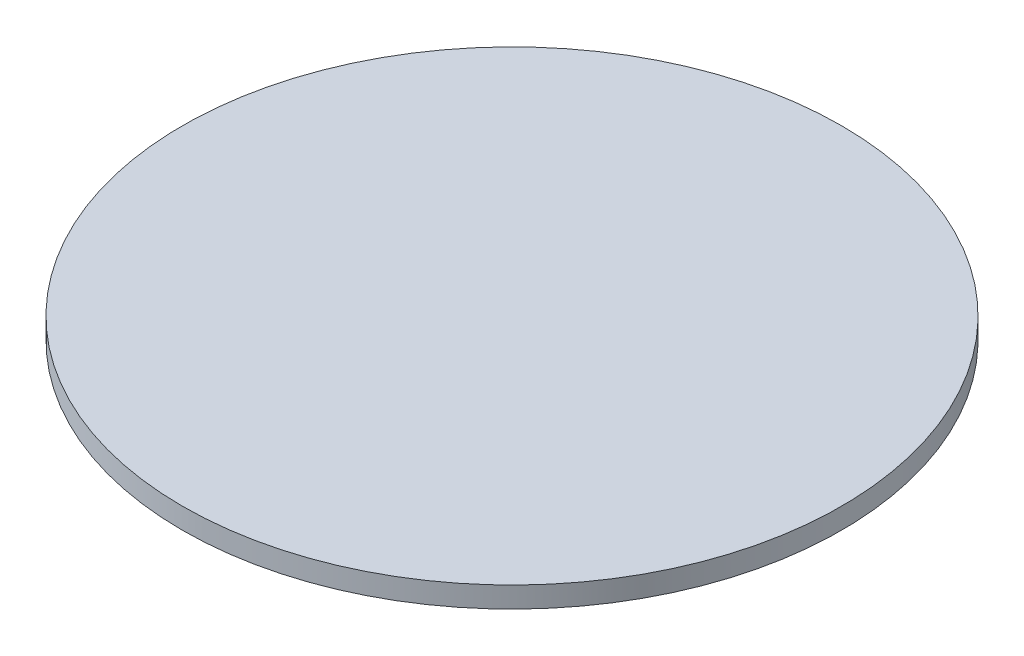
ISO-10303-21;
HEADER;
FILE_DESCRIPTION(('STEP AP214'),'2;1');
FILE_NAME('part.step','',(''),(''),'','','');
FILE_SCHEMA(('AUTOMOTIVE_DESIGN { 1 0 10303 214 1 1 1 1 }'));
ENDSEC;
DATA;
#1=APPLICATION_CONTEXT('core data for automotive mechanical design processes');
#2=APPLICATION_PROTOCOL_DEFINITION('international standard','automotive_design',2000,#1);
#3=PRODUCT_CONTEXT('',#1,'mechanical');
#4=PRODUCT('Part','Part','',(#3));
#5=PRODUCT_RELATED_PRODUCT_CATEGORY('part','',(#4));
#6=PRODUCT_DEFINITION_FORMATION('','',#4);
#7=PRODUCT_DEFINITION_CONTEXT('part definition',#1,'design');
#8=PRODUCT_DEFINITION('design','',#6,#7);
#9=PRODUCT_DEFINITION_SHAPE('','',#8);
#10=(LENGTH_UNIT() NAMED_UNIT(*) SI_UNIT(.MILLI.,.METRE.));
#11=(NAMED_UNIT(*) PLANE_ANGLE_UNIT() SI_UNIT($,.RADIAN.));
#12=(NAMED_UNIT(*) SI_UNIT($,.STERADIAN.) SOLID_ANGLE_UNIT());
#13=UNCERTAINTY_MEASURE_WITH_UNIT(LENGTH_MEASURE(1.E-05),#10,'distance_accuracy_value','');
#14=(GEOMETRIC_REPRESENTATION_CONTEXT(3) GLOBAL_UNCERTAINTY_ASSIGNED_CONTEXT((#13)) GLOBAL_UNIT_ASSIGNED_CONTEXT((#10,
#11,#12)) REPRESENTATION_CONTEXT('',''));
#15=CARTESIAN_POINT('',(0.,0.,0.));
#16=DIRECTION('',(0.,0.,1.));
#17=DIRECTION('',(1.,0.,0.));
#18=AXIS2_PLACEMENT_3D('',#15,#16,#17);
#19=CARTESIAN_POINT('',(0.,6.35,0.));
#20=DIRECTION('',(0.,-1.,0.));
#21=DIRECTION('',(0.,0.,-1.));
#22=AXIS2_PLACEMENT_3D('',#19,#20,#21);
#23=CYLINDRICAL_SURFACE('',#22,100.33);
#24=CARTESIAN_POINT('',(0.,6.35,0.));
#25=DIRECTION('',(0.,1.,0.));
#26=DIRECTION('',(0.,0.,1.));
#27=AXIS2_PLACEMENT_3D('',#24,#25,#26);
#28=CIRCLE('',#27,100.33);
#29=CARTESIAN_POINT('',(0.,6.35,100.33));
#30=VERTEX_POINT('',#29);
#31=EDGE_CURVE('E10',#30,#30,#28,.T.);
#32=ORIENTED_EDGE('',*,*,#31,.F.);
#33=EDGE_LOOP('',(#32));
#34=FACE_BOUND('',#33,.T.);
#35=CARTESIAN_POINT('',(0.,0.,0.));
#36=DIRECTION('',(0.,1.,0.));
#37=DIRECTION('',(0.,0.,1.));
#38=AXIS2_PLACEMENT_3D('',#35,#36,#37);
#39=CIRCLE('',#38,100.33);
#40=CARTESIAN_POINT('',(0.,0.,100.33));
#41=VERTEX_POINT('',#40);
#42=EDGE_CURVE('E34',#41,#41,#39,.T.);
#43=ORIENTED_EDGE('',*,*,#42,.T.);
#44=EDGE_LOOP('',(#43));
#45=FACE_BOUND('',#44,.T.);
#46=ADVANCED_FACE('F31',(#34,#45),#23,.T.);
#47=CARTESIAN_POINT('',(0.,6.35,0.));
#48=DIRECTION('',(0.,1.,0.));
#49=DIRECTION('',(0.,0.,1.));
#50=AXIS2_PLACEMENT_3D('',#47,#48,#49);
#51=PLANE('',#50);
#52=ORIENTED_EDGE('',*,*,#31,.T.);
#53=EDGE_LOOP('',(#52));
#54=FACE_BOUND('',#53,.T.);
#55=ADVANCED_FACE('F46',(#54),#51,.T.);
#56=CARTESIAN_POINT('',(0.,0.,0.));
#57=DIRECTION('',(0.,1.,0.));
#58=DIRECTION('',(0.,0.,1.));
#59=AXIS2_PLACEMENT_3D('',#56,#57,#58);
#60=PLANE('',#59);
#61=ORIENTED_EDGE('',*,*,#42,.F.);
#62=EDGE_LOOP('',(#61));
#63=FACE_BOUND('',#62,.T.);
#64=ADVANCED_FACE('F44',(#63),#60,.F.);
#65=CLOSED_SHELL('',(#46,#55,#64));
#66=MANIFOLD_SOLID_BREP('B2',#65);
#67=ADVANCED_BREP_SHAPE_REPRESENTATION('',(#18,#66),#14);
#68=SHAPE_DEFINITION_REPRESENTATION(#9,#67);
ENDSEC;
END-ISO-10303-21;
